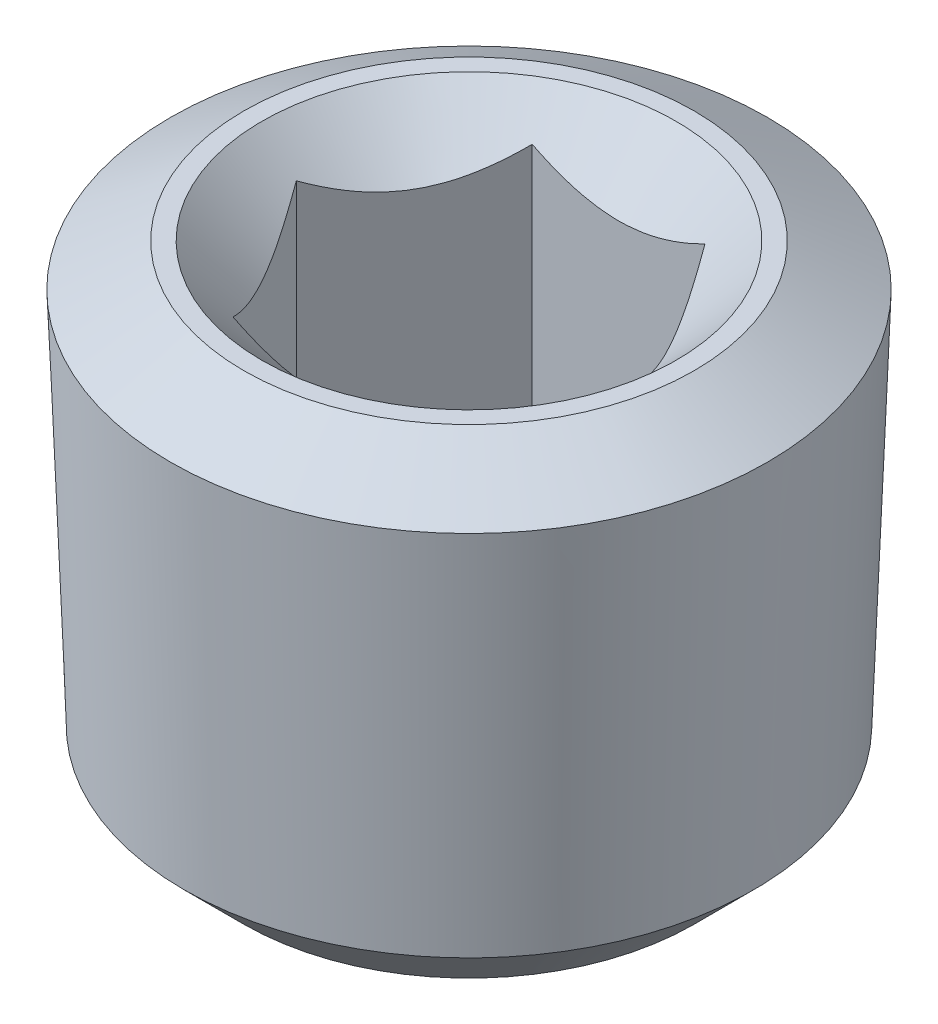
ISO-10303-21;
HEADER;
FILE_DESCRIPTION(('STEP AP214'),'2;1');
FILE_NAME('part.step','',(''),(''),'','','');
FILE_SCHEMA(('AUTOMOTIVE_DESIGN { 1 0 10303 214 1 1 1 1 }'));
ENDSEC;
DATA;
#1=APPLICATION_CONTEXT('core data for automotive mechanical design processes');
#2=APPLICATION_PROTOCOL_DEFINITION('international standard','automotive_design',2000,#1);
#3=PRODUCT_CONTEXT('',#1,'mechanical');
#4=PRODUCT('Part','Part','',(#3));
#5=PRODUCT_RELATED_PRODUCT_CATEGORY('part','',(#4));
#6=PRODUCT_DEFINITION_FORMATION('','',#4);
#7=PRODUCT_DEFINITION_CONTEXT('part definition',#1,'design');
#8=PRODUCT_DEFINITION('design','',#6,#7);
#9=PRODUCT_DEFINITION_SHAPE('','',#8);
#10=(LENGTH_UNIT() NAMED_UNIT(*) SI_UNIT(.MILLI.,.METRE.));
#11=(NAMED_UNIT(*) PLANE_ANGLE_UNIT() SI_UNIT($,.RADIAN.));
#12=(NAMED_UNIT(*) SI_UNIT($,.STERADIAN.) SOLID_ANGLE_UNIT());
#13=UNCERTAINTY_MEASURE_WITH_UNIT(LENGTH_MEASURE(1.E-05),#10,'distance_accuracy_value','');
#14=(GEOMETRIC_REPRESENTATION_CONTEXT(3) GLOBAL_UNCERTAINTY_ASSIGNED_CONTEXT((#13)) GLOBAL_UNIT_ASSIGNED_CONTEXT((#10,
#11,#12)) REPRESENTATION_CONTEXT('',''));
#15=CARTESIAN_POINT('',(0.,0.,0.));
#16=DIRECTION('',(0.,0.,1.));
#17=DIRECTION('',(1.,0.,0.));
#18=AXIS2_PLACEMENT_3D('',#15,#16,#17);
#19=CARTESIAN_POINT('',(0.,0.,0.));
#20=DIRECTION('',(0.,1.,0.));
#21=DIRECTION('',(0.,0.,1.));
#22=AXIS2_PLACEMENT_3D('',#19,#20,#21);
#23=PLANE('',#22);
#24=CARTESIAN_POINT('',(0.,0.,0.));
#25=DIRECTION('',(0.,1.,0.));
#26=DIRECTION('',(0.,0.,1.));
#27=AXIS2_PLACEMENT_3D('',#24,#25,#26);
#28=CIRCLE('',#27,2.7432);
#29=CARTESIAN_POINT('',(0.,0.,2.7432));
#30=VERTEX_POINT('',#29);
#31=EDGE_CURVE('E252',#30,#30,#28,.T.);
#32=ORIENTED_EDGE('',*,*,#31,.F.);
#33=EDGE_LOOP('',(#32));
#34=FACE_BOUND('',#33,.T.);
#35=CARTESIAN_POINT('',(0.,0.,0.));
#36=DIRECTION('',(0.,1.,0.));
#37=DIRECTION('',(0.,0.,1.));
#38=AXIS2_PLACEMENT_3D('',#35,#36,#37);
#39=CIRCLE('',#38,2.98158778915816);
#40=CARTESIAN_POINT('',(0.,0.,2.98158778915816));
#41=VERTEX_POINT('',#40);
#42=EDGE_CURVE('E12',#41,#41,#39,.T.);
#43=ORIENTED_EDGE('',*,*,#42,.T.);
#44=EDGE_LOOP('',(#43));
#45=FACE_BOUND('',#44,.T.);
#46=ADVANCED_FACE('F39',(#34,#45),#23,.T.);
#47=CARTESIAN_POINT('',(0.,0.,0.));
#48=DIRECTION('',(0.,-1.,0.));
#49=DIRECTION('',(0.,0.,-1.));
#50=AXIS2_PLACEMENT_3D('',#47,#48,#49);
#51=CONICAL_SURFACE('',#50,2.98158778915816,1.0471975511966);
#52=CARTESIAN_POINT('',(0.,-0.561779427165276,0.));
#53=DIRECTION('',(0.,1.,0.));
#54=DIRECTION('',(0.,0.,1.));
#55=AXIS2_PLACEMENT_3D('',#52,#53,#54);
#56=CIRCLE('',#55,3.95461829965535);
#57=CARTESIAN_POINT('',(0.,-0.561779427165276,3.95461829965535));
#58=VERTEX_POINT('',#57);
#59=EDGE_CURVE('E46',#58,#58,#56,.T.);
#60=ORIENTED_EDGE('',*,*,#59,.T.);
#61=EDGE_LOOP('',(#60));
#62=FACE_BOUND('',#61,.T.);
#63=ORIENTED_EDGE('',*,*,#42,.F.);
#64=EDGE_LOOP('',(#63));
#65=FACE_BOUND('',#64,.T.);
#66=ADVANCED_FACE('F242',(#62,#65),#51,.T.);
#67=CARTESIAN_POINT('',(0.,-0.561779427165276,0.));
#68=DIRECTION('',(0.,1.,0.));
#69=DIRECTION('',(0.,0.,1.));
#70=AXIS2_PLACEMENT_3D('',#67,#68,#69);
#71=CONICAL_SURFACE('',#70,3.95461829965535,0.0364424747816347);
#72=CARTESIAN_POINT('',(0.,-5.55916733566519,0.));
#73=DIRECTION('',(0.,1.,0.));
#74=DIRECTION('',(0.,0.,1.));
#75=AXIS2_PLACEMENT_3D('',#72,#73,#74);
#76=CIRCLE('',#75,3.77242045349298);
#77=CARTESIAN_POINT('',(0.,-5.55916733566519,3.77242045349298));
#78=VERTEX_POINT('',#77);
#79=EDGE_CURVE('E260',#78,#78,#76,.T.);
#80=ORIENTED_EDGE('',*,*,#79,.T.);
#81=EDGE_LOOP('',(#80));
#82=FACE_BOUND('',#81,.T.);
#83=ORIENTED_EDGE('',*,*,#59,.F.);
#84=EDGE_LOOP('',(#83));
#85=FACE_BOUND('',#84,.T.);
#86=ADVANCED_FACE('F247',(#82,#85),#71,.T.);
#87=CARTESIAN_POINT('',(0.,-5.55916733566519,0.));
#88=DIRECTION('',(0.,1.,0.));
#89=DIRECTION('',(0.,0.,1.));
#90=AXIS2_PLACEMENT_3D('',#87,#88,#89);
#91=CONICAL_SURFACE('',#90,3.77242045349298,0.785398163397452);
#92=CARTESIAN_POINT('',(0.,-6.35,0.));
#93=DIRECTION('',(0.,1.,0.));
#94=DIRECTION('',(0.,0.,1.));
#95=AXIS2_PLACEMENT_3D('',#92,#93,#94);
#96=CIRCLE('',#95,2.98158778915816);
#97=CARTESIAN_POINT('',(0.,-6.35,2.98158778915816));
#98=VERTEX_POINT('',#97);
#99=EDGE_CURVE('E256',#98,#98,#96,.T.);
#100=ORIENTED_EDGE('',*,*,#99,.T.);
#101=EDGE_LOOP('',(#100));
#102=FACE_BOUND('',#101,.T.);
#103=ORIENTED_EDGE('',*,*,#79,.F.);
#104=EDGE_LOOP('',(#103));
#105=FACE_BOUND('',#104,.T.);
#106=ADVANCED_FACE('F270',(#102,#105),#91,.T.);
#107=CARTESIAN_POINT('',(-2.98158778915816,-6.35,0.));
#108=DIRECTION('',(0.,-1.,0.));
#109=DIRECTION('',(0.,0.,-1.));
#110=AXIS2_PLACEMENT_3D('',#107,#108,#109);
#111=PLANE('',#110);
#112=ORIENTED_EDGE('',*,*,#99,.F.);
#113=EDGE_LOOP('',(#112));
#114=FACE_BOUND('',#113,.T.);
#115=ADVANCED_FACE('F186',(#114),#111,.T.);
#116=CARTESIAN_POINT('',(0.,0.,0.));
#117=DIRECTION('',(0.,1.,0.));
#118=DIRECTION('',(0.,0.,1.));
#119=AXIS2_PLACEMENT_3D('',#116,#117,#118);
#120=CONICAL_SURFACE('',#119,2.7432,0.785398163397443);
#121=CARTESIAN_POINT('',(-2.57510355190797,0.505847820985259,1.9812));
#122=CARTESIAN_POINT('',(-2.51354578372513,0.457069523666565,1.9812));
#123=CARTESIAN_POINT('',(-2.45167860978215,0.408675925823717,1.9812));
#124=CARTESIAN_POINT('',(-2.32719174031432,0.312839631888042,1.9812));
#125=CARTESIAN_POINT('',(-2.26457188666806,0.265397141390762,1.9812));
#126=CARTESIAN_POINT('',(-2.13799293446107,0.171309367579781,1.9812));
#127=CARTESIAN_POINT('',(-2.07402727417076,0.124672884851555,1.9812));
#128=CARTESIAN_POINT('',(-1.94507265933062,0.0328422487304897,1.9812));
#129=CARTESIAN_POINT('',(-1.88008377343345,-0.0123520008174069,1.9812));
#130=CARTESIAN_POINT('',(-1.74397621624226,-0.104279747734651,1.9812));
#131=CARTESIAN_POINT('',(-1.67276336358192,-0.150874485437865,1.9812));
#132=CARTESIAN_POINT('',(-1.52868136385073,-0.241424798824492,1.9812));
#133=CARTESIAN_POINT('',(-1.45581242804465,-0.285380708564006,1.9812));
#134=CARTESIAN_POINT('',(-1.30832056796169,-0.369762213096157,1.9812));
#135=CARTESIAN_POINT('',(-1.23370327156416,-0.410197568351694,1.9812));
#136=CARTESIAN_POINT('',(-1.08224421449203,-0.486624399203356,1.9812));
#137=CARTESIAN_POINT('',(-1.00540359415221,-0.522618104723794,1.9812));
#138=CARTESIAN_POINT('',(-0.859075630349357,-0.584647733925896,1.9812));
#139=CARTESIAN_POINT('',(-0.789880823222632,-0.611366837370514,1.9812));
#140=CARTESIAN_POINT('',(-0.649566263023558,-0.659274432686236,1.9812));
#141=CARTESIAN_POINT('',(-0.578446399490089,-0.68046260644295,1.9812));
#142=CARTESIAN_POINT('',(-0.436050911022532,-0.715727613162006,1.9812));
#143=CARTESIAN_POINT('',(-0.36481123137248,-0.729947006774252,1.9812));
#144=CARTESIAN_POINT('',(-0.221237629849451,-0.750948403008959,1.9812));
#145=CARTESIAN_POINT('',(-0.14890402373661,-0.757732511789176,1.9812));
#146=CARTESIAN_POINT('',(-0.00820637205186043,-0.763156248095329,1.9812));
#147=CARTESIAN_POINT('',(0.0601400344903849,-0.762252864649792,1.9812));
#148=CARTESIAN_POINT('',(0.196377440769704,-0.753452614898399,1.9812));
#149=CARTESIAN_POINT('',(0.264268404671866,-0.745555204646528,1.9812));
#150=CARTESIAN_POINT('',(0.400266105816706,-0.723106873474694,1.9812));
#151=CARTESIAN_POINT('',(0.468351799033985,-0.708430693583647,1.9812));
#152=CARTESIAN_POINT('',(0.602982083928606,-0.673292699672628,1.9812));
#153=CARTESIAN_POINT('',(0.669526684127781,-0.652830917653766,1.9812));
#154=CARTESIAN_POINT('',(0.867724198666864,-0.583887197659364,1.9812));
#155=CARTESIAN_POINT('',(0.996810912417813,-0.528063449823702,1.9812));
#156=CARTESIAN_POINT('',(1.2489899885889,-0.403752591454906,1.9812));
#157=CARTESIAN_POINT('',(1.3720599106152,-0.335222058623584,1.9812));
#158=CARTESIAN_POINT('',(1.54997195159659,-0.228144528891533,1.9812));
#159=CARTESIAN_POINT('',(1.60673701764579,-0.192728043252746,1.9812));
#160=CARTESIAN_POINT('',(1.71929230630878,-0.120366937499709,1.9812));
#161=CARTESIAN_POINT('',(1.77508245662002,-0.0834222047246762,1.9812));
#162=CARTESIAN_POINT('',(1.88537126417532,-0.00857930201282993,1.9812));
#163=CARTESIAN_POINT('',(1.93987664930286,0.0293090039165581,1.9812));
#164=CARTESIAN_POINT('',(2.04813768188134,0.106112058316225,1.9812));
#165=CARTESIAN_POINT('',(2.10189353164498,0.145026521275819,1.9812));
#166=CARTESIAN_POINT('',(2.15533457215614,0.184362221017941,1.9812));
#167=B_SPLINE_CURVE_WITH_KNOTS('',3,(#121,#122,#123,#124,#125,#126,#127,#128,#129,#130,#131,
#132,#133,#134,#135,#136,#137,#138,#139,#140,#141,#142,#143,#144,#145,#146,#147,#148,#149,#150,
#151,#152,#153,#154,#155,#156,#157,#158,#159,#160,#161,#162,#163,#164,#165,#166),.UNSPECIFIED.,
.F.,.F.,(4,2,2,2,2,2,2,2,2,2,2,2,2,2,2,2,2,2,2,2,2,2,4),(0.,0.235626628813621,0.471303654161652,
0.708772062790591,0.946224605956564,1.20148543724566,1.4567138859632,1.71121056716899,
1.9655789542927,2.18791541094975,2.41026465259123,2.62785270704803,2.84537911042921,
3.0500690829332,3.25477497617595,3.46342485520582,3.67207358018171,4.09278433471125,
4.51496018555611,4.71566341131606,4.91638145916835,5.11551042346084,5.31458455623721),.UNSPECIFIED.);
#168=CARTESIAN_POINT('',(1.14384635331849,-0.455507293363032,1.9812));
#169=VERTEX_POINT('',#168);
#170=CARTESIAN_POINT('',(-1.14384635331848,-0.455507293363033,1.9812));
#171=VERTEX_POINT('',#170);
#172=EDGE_CURVE('E53',#169,#171,#167,.F.);
#173=ORIENTED_EDGE('',*,*,#172,.T.);
#174=CARTESIAN_POINT('',(-1.14373088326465,-0.455391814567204,1.9814));
#175=CARTESIAN_POINT('',(-1.18305240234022,-0.494681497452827,1.91329313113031));
#176=CARTESIAN_POINT('',(-1.22303144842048,-0.531663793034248,1.84404739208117));
#177=CARTESIAN_POINT('',(-1.30455323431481,-0.599377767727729,1.70284751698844));
#178=CARTESIAN_POINT('',(-1.34610372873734,-0.630071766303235,1.63087994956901));
#179=CARTESIAN_POINT('',(-1.4298883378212,-0.682651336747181,1.48576074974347));
#180=CARTESIAN_POINT('',(-1.47210111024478,-0.70466907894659,1.41264608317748));
#181=CARTESIAN_POINT('',(-1.55745605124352,-0.738592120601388,1.26480698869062));
#182=CARTESIAN_POINT('',(-1.60059561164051,-0.750522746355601,1.19008707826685));
#183=CARTESIAN_POINT('',(-1.67494288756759,-0.761287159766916,1.0613138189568));
#184=CARTESIAN_POINT('',(-1.70605452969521,-0.76288080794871,1.00742687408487));
#185=CARTESIAN_POINT('',(-1.76822697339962,-0.760197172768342,0.899741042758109));
#186=CARTESIAN_POINT('',(-1.7992877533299,-0.755917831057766,0.845942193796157));
#187=CARTESIAN_POINT('',(-1.86111604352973,-0.741731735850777,0.738852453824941));
#188=CARTESIAN_POINT('',(-1.8918831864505,-0.731818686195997,0.685562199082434));
#189=CARTESIAN_POINT('',(-1.95288543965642,-0.706909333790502,0.579903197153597));
#190=CARTESIAN_POINT('',(-1.98312059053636,-0.691913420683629,0.527534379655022));
#191=CARTESIAN_POINT('',(-2.06057049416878,-0.647391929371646,0.393387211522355));
#192=CARTESIAN_POINT('',(-2.10730489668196,-0.614509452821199,0.312440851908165));
#193=CARTESIAN_POINT('',(-2.17602360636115,-0.558998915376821,0.19341655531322));
#194=CARTESIAN_POINT('',(-2.19866947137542,-0.539495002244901,0.15419276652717));
#195=CARTESIAN_POINT('',(-2.24354167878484,-0.498709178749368,0.0764718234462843));
#196=CARTESIAN_POINT('',(-2.26576826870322,-0.477428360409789,0.0379742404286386));
#197=CARTESIAN_POINT('',(-2.28780817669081,-0.455391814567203,-0.000200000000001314));
#198=B_SPLINE_CURVE_WITH_KNOTS('',3,(#174,#175,#176,#177,#178,#179,#180,#181,#182,#183,#184,
#185,#186,#187,#188,#189,#190,#191,#192,#193,#194,#195,#196,#197),.UNSPECIFIED.,.F.,.F.,(4,2,2,
2,2,2,2,2,2,2,2,4),(0.,0.263916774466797,0.529371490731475,0.79060967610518,1.05118999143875,
1.23765676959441,1.42418891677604,1.61092994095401,1.79765665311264,2.09428646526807,
2.24219924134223,2.39002177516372),.UNSPECIFIED.);
#199=CARTESIAN_POINT('',(-2.28769270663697,-0.455507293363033,0.));
#200=VERTEX_POINT('',#199);
#201=EDGE_CURVE('E128',#171,#200,#198,.T.);
#202=ORIENTED_EDGE('',*,*,#201,.T.);
#203=CARTESIAN_POINT('',(-2.28780817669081,-0.455391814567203,0.000199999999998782));
#204=CARTESIAN_POINT('',(-2.24848665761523,-0.494681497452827,-0.0679068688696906));
#205=CARTESIAN_POINT('',(-2.20850761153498,-0.531663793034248,-0.137152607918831));
#206=CARTESIAN_POINT('',(-2.12698582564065,-0.599377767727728,-0.278352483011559));
#207=CARTESIAN_POINT('',(-2.08543533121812,-0.630071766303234,-0.350320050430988));
#208=CARTESIAN_POINT('',(-2.00165072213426,-0.68265133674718,-0.495439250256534));
#209=CARTESIAN_POINT('',(-1.95943794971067,-0.704669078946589,-0.568553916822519));
#210=CARTESIAN_POINT('',(-1.87408300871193,-0.738592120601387,-0.71639301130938));
#211=CARTESIAN_POINT('',(-1.83094344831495,-0.750522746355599,-0.791112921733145));
#212=CARTESIAN_POINT('',(-1.75659617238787,-0.761287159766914,-0.919886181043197));
#213=CARTESIAN_POINT('',(-1.72548453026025,-0.762880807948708,-0.973773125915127));
#214=CARTESIAN_POINT('',(-1.66331208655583,-0.76019717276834,-1.08145895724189));
#215=CARTESIAN_POINT('',(-1.63225130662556,-0.755917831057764,-1.13525780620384));
#216=CARTESIAN_POINT('',(-1.57042301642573,-0.741731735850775,-1.24234754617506));
#217=CARTESIAN_POINT('',(-1.53965587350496,-0.731818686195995,-1.29563780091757));
#218=CARTESIAN_POINT('',(-1.47865362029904,-0.7069093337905,-1.4012968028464));
#219=CARTESIAN_POINT('',(-1.44841846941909,-0.691913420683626,-1.45366562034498));
#220=CARTESIAN_POINT('',(-1.37096856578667,-0.647391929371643,-1.58781278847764));
#221=CARTESIAN_POINT('',(-1.3242341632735,-0.614509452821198,-1.66875914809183));
#222=CARTESIAN_POINT('',(-1.2555154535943,-0.558998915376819,-1.78778344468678));
#223=CARTESIAN_POINT('',(-1.23286958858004,-0.5394950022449,-1.82700723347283));
#224=CARTESIAN_POINT('',(-1.18799738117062,-0.498709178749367,-1.90472817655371));
#225=CARTESIAN_POINT('',(-1.16577079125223,-0.477428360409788,-1.94322575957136));
#226=CARTESIAN_POINT('',(-1.14373088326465,-0.455391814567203,-1.9814));
#227=B_SPLINE_CURVE_WITH_KNOTS('',3,(#203,#204,#205,#206,#207,#208,#209,#210,#211,#212,#213,
#214,#215,#216,#217,#218,#219,#220,#221,#222,#223,#224,#225,#226),.UNSPECIFIED.,.F.,.F.,(4,2,2,
2,2,2,2,2,2,2,2,4),(0.,0.263916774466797,0.529371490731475,0.790609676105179,1.05118999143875,
1.23765676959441,1.42418891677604,1.61092994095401,1.79765665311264,2.09428646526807,
2.24219924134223,2.39002177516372),.UNSPECIFIED.);
#228=CARTESIAN_POINT('',(-1.14384635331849,-0.455507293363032,-1.9812));
#229=VERTEX_POINT('',#228);
#230=EDGE_CURVE('E209',#200,#229,#227,.T.);
#231=ORIENTED_EDGE('',*,*,#230,.T.);
#232=CARTESIAN_POINT('',(-2.57510355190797,0.505847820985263,-1.9812));
#233=CARTESIAN_POINT('',(-2.51354578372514,0.457069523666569,-1.9812));
#234=CARTESIAN_POINT('',(-2.45167860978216,0.408675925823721,-1.9812));
#235=CARTESIAN_POINT('',(-2.32719174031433,0.312839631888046,-1.9812));
#236=CARTESIAN_POINT('',(-2.26457188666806,0.265397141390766,-1.9812));
#237=CARTESIAN_POINT('',(-2.13799293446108,0.171309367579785,-1.9812));
#238=CARTESIAN_POINT('',(-2.07402727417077,0.124672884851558,-1.9812));
#239=CARTESIAN_POINT('',(-1.94507265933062,0.0328422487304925,-1.9812));
#240=CARTESIAN_POINT('',(-1.88008377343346,-0.0123520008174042,-1.9812));
#241=CARTESIAN_POINT('',(-1.74397621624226,-0.104279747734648,-1.9812));
#242=CARTESIAN_POINT('',(-1.67276336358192,-0.150874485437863,-1.9812));
#243=CARTESIAN_POINT('',(-1.52868136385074,-0.24142479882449,-1.9812));
#244=CARTESIAN_POINT('',(-1.45581242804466,-0.285380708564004,-1.9812));
#245=CARTESIAN_POINT('',(-1.30832056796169,-0.369762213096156,-1.9812));
#246=CARTESIAN_POINT('',(-1.23370327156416,-0.410197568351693,-1.9812));
#247=CARTESIAN_POINT('',(-1.08224421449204,-0.486624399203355,-1.9812));
#248=CARTESIAN_POINT('',(-1.00540359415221,-0.522618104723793,-1.9812));
#249=CARTESIAN_POINT('',(-0.859075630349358,-0.584647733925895,-1.9812));
#250=CARTESIAN_POINT('',(-0.789880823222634,-0.611366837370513,-1.9812));
#251=CARTESIAN_POINT('',(-0.649566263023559,-0.659274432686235,-1.9812));
#252=CARTESIAN_POINT('',(-0.57844639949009,-0.680462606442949,-1.9812));
#253=CARTESIAN_POINT('',(-0.436050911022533,-0.715727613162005,-1.9812));
#254=CARTESIAN_POINT('',(-0.364811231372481,-0.729947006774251,-1.9812));
#255=CARTESIAN_POINT('',(-0.221237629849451,-0.750948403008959,-1.9812));
#256=CARTESIAN_POINT('',(-0.148904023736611,-0.757732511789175,-1.9812));
#257=CARTESIAN_POINT('',(-0.00820637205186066,-0.763156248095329,-1.9812));
#258=CARTESIAN_POINT('',(0.0601400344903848,-0.762252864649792,-1.9812));
#259=CARTESIAN_POINT('',(0.196377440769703,-0.753452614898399,-1.9812));
#260=CARTESIAN_POINT('',(0.264268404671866,-0.745555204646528,-1.9812));
#261=CARTESIAN_POINT('',(0.400266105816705,-0.723106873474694,-1.9812));
#262=CARTESIAN_POINT('',(0.468351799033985,-0.708430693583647,-1.9812));
#263=CARTESIAN_POINT('',(0.602982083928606,-0.673292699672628,-1.9812));
#264=CARTESIAN_POINT('',(0.669526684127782,-0.652830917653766,-1.9812));
#265=CARTESIAN_POINT('',(0.867724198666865,-0.583887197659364,-1.9812));
#266=CARTESIAN_POINT('',(0.996810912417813,-0.528063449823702,-1.9812));
#267=CARTESIAN_POINT('',(1.2489899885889,-0.403752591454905,-1.9812));
#268=CARTESIAN_POINT('',(1.3720599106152,-0.335222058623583,-1.9812));
#269=CARTESIAN_POINT('',(1.54997195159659,-0.228144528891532,-1.9812));
#270=CARTESIAN_POINT('',(1.60673701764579,-0.192728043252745,-1.9812));
#271=CARTESIAN_POINT('',(1.71929230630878,-0.120366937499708,-1.9812));
#272=CARTESIAN_POINT('',(1.77508245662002,-0.0834222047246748,-1.9812));
#273=CARTESIAN_POINT('',(1.88537126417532,-0.00857930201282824,-1.9812));
#274=CARTESIAN_POINT('',(1.93987664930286,0.0293090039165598,-1.9812));
#275=CARTESIAN_POINT('',(2.04813768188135,0.106112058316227,-1.9812));
#276=CARTESIAN_POINT('',(2.10189353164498,0.145026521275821,-1.9812));
#277=CARTESIAN_POINT('',(2.15533457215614,0.184362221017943,-1.9812));
#278=B_SPLINE_CURVE_WITH_KNOTS('',3,(#232,#233,#234,#235,#236,#237,#238,#239,#240,#241,#242,
#243,#244,#245,#246,#247,#248,#249,#250,#251,#252,#253,#254,#255,#256,#257,#258,#259,#260,#261,
#262,#263,#264,#265,#266,#267,#268,#269,#270,#271,#272,#273,#274,#275,#276,#277),.UNSPECIFIED.,
.F.,.F.,(4,2,2,2,2,2,2,2,2,2,2,2,2,2,2,2,2,2,2,2,2,2,4),(0.,0.235626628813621,0.471303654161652,
0.708772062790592,0.946224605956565,1.20148543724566,1.4567138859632,1.71121056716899,
1.96557895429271,2.18791541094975,2.41026465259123,2.62785270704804,2.84537911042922,
3.05006908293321,3.25477497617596,3.46342485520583,3.67207358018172,4.09278433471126,
4.51496018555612,4.71566341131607,4.91638145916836,5.11551042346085,5.31458455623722),.UNSPECIFIED.);
#279=CARTESIAN_POINT('',(1.14384635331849,-0.455507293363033,-1.9812));
#280=VERTEX_POINT('',#279);
#281=EDGE_CURVE('E202',#229,#280,#278,.T.);
#282=ORIENTED_EDGE('',*,*,#281,.T.);
#283=CARTESIAN_POINT('',(1.14373088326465,-0.455391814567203,-1.9814));
#284=CARTESIAN_POINT('',(1.18305240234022,-0.494681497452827,-1.91329313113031));
#285=CARTESIAN_POINT('',(1.22303144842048,-0.531663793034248,-1.84404739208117));
#286=CARTESIAN_POINT('',(1.30455323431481,-0.599377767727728,-1.70284751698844));
#287=CARTESIAN_POINT('',(1.34610372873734,-0.630071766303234,-1.63087994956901));
#288=CARTESIAN_POINT('',(1.4298883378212,-0.68265133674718,-1.48576074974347));
#289=CARTESIAN_POINT('',(1.47210111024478,-0.704669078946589,-1.41264608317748));
#290=CARTESIAN_POINT('',(1.55745605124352,-0.738592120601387,-1.26480698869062));
#291=CARTESIAN_POINT('',(1.60059561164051,-0.750522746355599,-1.19008707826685));
#292=CARTESIAN_POINT('',(1.67494288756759,-0.761287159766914,-1.0613138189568));
#293=CARTESIAN_POINT('',(1.70605452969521,-0.762880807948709,-1.00742687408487));
#294=CARTESIAN_POINT('',(1.76822697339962,-0.760197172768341,-0.899741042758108));
#295=CARTESIAN_POINT('',(1.7992877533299,-0.755917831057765,-0.845942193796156));
#296=CARTESIAN_POINT('',(1.86111604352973,-0.741731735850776,-0.73885245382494));
#297=CARTESIAN_POINT('',(1.8918831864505,-0.731818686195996,-0.685562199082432));
#298=CARTESIAN_POINT('',(1.95288543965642,-0.7069093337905,-0.579903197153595));
#299=CARTESIAN_POINT('',(1.98312059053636,-0.691913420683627,-0.527534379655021));
#300=CARTESIAN_POINT('',(2.06057049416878,-0.647391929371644,-0.393387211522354));
#301=CARTESIAN_POINT('',(2.10730489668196,-0.614509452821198,-0.312440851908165));
#302=CARTESIAN_POINT('',(2.17602360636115,-0.55899891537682,-0.193416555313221));
#303=CARTESIAN_POINT('',(2.19866947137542,-0.539495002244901,-0.154192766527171));
#304=CARTESIAN_POINT('',(2.24354167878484,-0.498709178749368,-0.076471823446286));
#305=CARTESIAN_POINT('',(2.26576826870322,-0.477428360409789,-0.0379742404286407));
#306=CARTESIAN_POINT('',(2.28780817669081,-0.455391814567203,0.00019999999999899));
#307=B_SPLINE_CURVE_WITH_KNOTS('',3,(#283,#284,#285,#286,#287,#288,#289,#290,#291,#292,#293,
#294,#295,#296,#297,#298,#299,#300,#301,#302,#303,#304,#305,#306),.UNSPECIFIED.,.F.,.F.,(4,2,2,
2,2,2,2,2,2,2,2,4),(0.,0.263916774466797,0.529371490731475,0.79060967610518,1.05118999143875,
1.23765676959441,1.42418891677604,1.61092994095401,1.79765665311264,2.09428646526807,
2.24219924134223,2.39002177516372),.UNSPECIFIED.);
#308=CARTESIAN_POINT('',(2.28769270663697,-0.455507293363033,0.));
#309=VERTEX_POINT('',#308);
#310=EDGE_CURVE('E195',#280,#309,#307,.T.);
#311=ORIENTED_EDGE('',*,*,#310,.T.);
#312=CARTESIAN_POINT('',(2.28780817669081,-0.455391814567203,-0.00020000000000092));
#313=CARTESIAN_POINT('',(2.24848665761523,-0.494681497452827,0.0679068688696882));
#314=CARTESIAN_POINT('',(2.20850761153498,-0.531663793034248,0.137152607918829));
#315=CARTESIAN_POINT('',(2.12698582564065,-0.599377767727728,0.278352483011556));
#316=CARTESIAN_POINT('',(2.08543533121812,-0.630071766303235,0.350320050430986));
#317=CARTESIAN_POINT('',(2.00165072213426,-0.682651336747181,0.495439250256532));
#318=CARTESIAN_POINT('',(1.95943794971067,-0.704669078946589,0.568553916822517));
#319=CARTESIAN_POINT('',(1.87408300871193,-0.738592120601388,0.716393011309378));
#320=CARTESIAN_POINT('',(1.83094344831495,-0.7505227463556,0.791112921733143));
#321=CARTESIAN_POINT('',(1.75659617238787,-0.761287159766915,0.919886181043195));
#322=CARTESIAN_POINT('',(1.72548453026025,-0.762880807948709,0.973773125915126));
#323=CARTESIAN_POINT('',(1.66331208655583,-0.760197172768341,1.08145895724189));
#324=CARTESIAN_POINT('',(1.63225130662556,-0.755917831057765,1.13525780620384));
#325=CARTESIAN_POINT('',(1.57042301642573,-0.741731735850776,1.24234754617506));
#326=CARTESIAN_POINT('',(1.53965587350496,-0.731818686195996,1.29563780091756));
#327=CARTESIAN_POINT('',(1.47865362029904,-0.706909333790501,1.4012968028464));
#328=CARTESIAN_POINT('',(1.44841846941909,-0.691913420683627,1.45366562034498));
#329=CARTESIAN_POINT('',(1.37096856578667,-0.647391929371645,1.58781278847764));
#330=CARTESIAN_POINT('',(1.3242341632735,-0.614509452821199,1.66875914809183));
#331=CARTESIAN_POINT('',(1.2555154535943,-0.55899891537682,1.78778344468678));
#332=CARTESIAN_POINT('',(1.23286958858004,-0.5394950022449,1.82700723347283));
#333=CARTESIAN_POINT('',(1.18799738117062,-0.498709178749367,1.90472817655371));
#334=CARTESIAN_POINT('',(1.16577079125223,-0.477428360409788,1.94322575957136));
#335=CARTESIAN_POINT('',(1.14373088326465,-0.455391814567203,1.9814));
#336=B_SPLINE_CURVE_WITH_KNOTS('',3,(#312,#313,#314,#315,#316,#317,#318,#319,#320,#321,#322,
#323,#324,#325,#326,#327,#328,#329,#330,#331,#332,#333,#334,#335),.UNSPECIFIED.,.F.,.F.,(4,2,2,
2,2,2,2,2,2,2,2,4),(0.,0.263916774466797,0.529371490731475,0.79060967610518,1.05118999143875,
1.23765676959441,1.42418891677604,1.61092994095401,1.79765665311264,2.09428646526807,
2.24219924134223,2.39002177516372),.UNSPECIFIED.);
#337=EDGE_CURVE('E172',#309,#169,#336,.T.);
#338=ORIENTED_EDGE('',*,*,#337,.T.);
#339=EDGE_LOOP('',(#173,#202,#231,#282,#311,#338));
#340=FACE_BOUND('',#339,.T.);
#341=ORIENTED_EDGE('',*,*,#31,.T.);
#342=EDGE_LOOP('',(#341));
#343=FACE_BOUND('',#342,.T.);
#344=ADVANCED_FACE('F181',(#340,#343),#120,.F.);
#345=CARTESIAN_POINT('',(-2.28769270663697,-3.81,0.));
#346=DIRECTION('',(-0.866025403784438,0.,0.5));
#347=DIRECTION('',(0.5,0.,0.866025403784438));
#348=AXIS2_PLACEMENT_3D('',#345,#346,#347);
#349=PLANE('',#348);
#350=DIRECTION('',(0.,1.,0.));
#351=VECTOR('',#350,1.);
#352=CARTESIAN_POINT('',(-1.14384635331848,-3.81,1.9812));
#353=LINE('',#352,#351);
#354=CARTESIAN_POINT('',(-1.14384635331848,-3.81,1.9812));
#355=VERTEX_POINT('',#354);
#356=EDGE_CURVE('E125',#355,#171,#353,.T.);
#357=ORIENTED_EDGE('',*,*,#356,.F.);
#358=DIRECTION('',(0.5,0.,0.866025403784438));
#359=VECTOR('',#358,1.);
#360=CARTESIAN_POINT('',(-2.28769270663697,-3.81,0.));
#361=LINE('',#360,#359);
#362=CARTESIAN_POINT('',(-1.71576952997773,-3.81,0.990599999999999));
#363=VERTEX_POINT('',#362);
#364=EDGE_CURVE('E112',#363,#355,#361,.T.);
#365=ORIENTED_EDGE('',*,*,#364,.F.);
#366=CARTESIAN_POINT('',(-2.28769270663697,-3.81,0.));
#367=VERTEX_POINT('',#366);
#368=EDGE_CURVE('E122',#367,#363,#361,.T.);
#369=ORIENTED_EDGE('',*,*,#368,.F.);
#370=DIRECTION('',(0.,1.,0.));
#371=VECTOR('',#370,1.);
#372=CARTESIAN_POINT('',(-2.28769270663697,-3.81,0.));
#373=LINE('',#372,#371);
#374=EDGE_CURVE('E152',#367,#200,#373,.T.);
#375=ORIENTED_EDGE('',*,*,#374,.T.);
#376=ORIENTED_EDGE('',*,*,#201,.F.);
#377=EDGE_LOOP('',(#357,#365,#369,#375,#376));
#378=FACE_BOUND('',#377,.T.);
#379=ADVANCED_FACE('F126',(#378),#349,.F.);
#380=CARTESIAN_POINT('',(-1.14384635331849,-3.81,-1.9812));
#381=DIRECTION('',(-0.866025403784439,0.,-0.5));
#382=DIRECTION('',(-0.5,0.,0.866025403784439));
#383=AXIS2_PLACEMENT_3D('',#380,#381,#382);
#384=PLANE('',#383);
#385=ORIENTED_EDGE('',*,*,#374,.F.);
#386=DIRECTION('',(-0.5,0.,0.866025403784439));
#387=VECTOR('',#386,1.);
#388=CARTESIAN_POINT('',(-1.14384635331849,-3.81,-1.9812));
#389=LINE('',#388,#387);
#390=CARTESIAN_POINT('',(-1.71576952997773,-3.81,-0.990599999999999));
#391=VERTEX_POINT('',#390);
#392=EDGE_CURVE('E149',#391,#367,#389,.T.);
#393=ORIENTED_EDGE('',*,*,#392,.F.);
#394=CARTESIAN_POINT('',(-1.14384635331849,-3.81,-1.9812));
#395=VERTEX_POINT('',#394);
#396=EDGE_CURVE('E131',#395,#391,#389,.T.);
#397=ORIENTED_EDGE('',*,*,#396,.F.);
#398=DIRECTION('',(0.,1.,0.));
#399=VECTOR('',#398,1.);
#400=CARTESIAN_POINT('',(-1.14384635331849,-3.81,-1.9812));
#401=LINE('',#400,#399);
#402=EDGE_CURVE('E154',#395,#229,#401,.T.);
#403=ORIENTED_EDGE('',*,*,#402,.T.);
#404=ORIENTED_EDGE('',*,*,#230,.F.);
#405=EDGE_LOOP('',(#385,#393,#397,#403,#404));
#406=FACE_BOUND('',#405,.T.);
#407=ADVANCED_FACE('F220',(#406),#384,.F.);
#408=CARTESIAN_POINT('',(1.14384635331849,-3.81,-1.9812));
#409=DIRECTION('',(0.,0.,-1.));
#410=DIRECTION('',(-1.,0.,0.));
#411=AXIS2_PLACEMENT_3D('',#408,#409,#410);
#412=PLANE('',#411);
#413=ORIENTED_EDGE('',*,*,#402,.F.);
#414=DIRECTION('',(-1.,0.,0.));
#415=VECTOR('',#414,1.);
#416=CARTESIAN_POINT('',(1.14384635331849,-3.81,-1.9812));
#417=LINE('',#416,#415);
#418=CARTESIAN_POINT('',(0.,-3.81,-1.9812));
#419=VERTEX_POINT('',#418);
#420=EDGE_CURVE('E145',#419,#395,#417,.T.);
#421=ORIENTED_EDGE('',*,*,#420,.F.);
#422=CARTESIAN_POINT('',(1.14384635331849,-3.81,-1.9812));
#423=VERTEX_POINT('',#422);
#424=EDGE_CURVE('E146',#423,#419,#417,.T.);
#425=ORIENTED_EDGE('',*,*,#424,.F.);
#426=DIRECTION('',(0.,1.,0.));
#427=VECTOR('',#426,1.);
#428=CARTESIAN_POINT('',(1.14384635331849,-3.81,-1.9812));
#429=LINE('',#428,#427);
#430=EDGE_CURVE('E157',#423,#280,#429,.T.);
#431=ORIENTED_EDGE('',*,*,#430,.T.);
#432=ORIENTED_EDGE('',*,*,#281,.F.);
#433=EDGE_LOOP('',(#413,#421,#425,#431,#432));
#434=FACE_BOUND('',#433,.T.);
#435=ADVANCED_FACE('F224',(#434),#412,.F.);
#436=CARTESIAN_POINT('',(2.28769270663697,-3.81,0.));
#437=DIRECTION('',(0.866025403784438,0.,-0.5));
#438=DIRECTION('',(-0.5,0.,-0.866025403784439));
#439=AXIS2_PLACEMENT_3D('',#436,#437,#438);
#440=PLANE('',#439);
#441=ORIENTED_EDGE('',*,*,#430,.F.);
#442=DIRECTION('',(-0.5,0.,-0.866025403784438));
#443=VECTOR('',#442,1.);
#444=CARTESIAN_POINT('',(2.28769270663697,-3.81,0.));
#445=LINE('',#444,#443);
#446=CARTESIAN_POINT('',(1.71576952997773,-3.81,-0.9906));
#447=VERTEX_POINT('',#446);
#448=EDGE_CURVE('E141',#447,#423,#445,.T.);
#449=ORIENTED_EDGE('',*,*,#448,.F.);
#450=CARTESIAN_POINT('',(2.28769270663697,-3.81,0.));
#451=VERTEX_POINT('',#450);
#452=EDGE_CURVE('E142',#451,#447,#445,.T.);
#453=ORIENTED_EDGE('',*,*,#452,.F.);
#454=DIRECTION('',(0.,1.,0.));
#455=VECTOR('',#454,1.);
#456=CARTESIAN_POINT('',(2.28769270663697,-3.81,0.));
#457=LINE('',#456,#455);
#458=EDGE_CURVE('E160',#451,#309,#457,.T.);
#459=ORIENTED_EDGE('',*,*,#458,.T.);
#460=ORIENTED_EDGE('',*,*,#310,.F.);
#461=EDGE_LOOP('',(#441,#449,#453,#459,#460));
#462=FACE_BOUND('',#461,.T.);
#463=ADVANCED_FACE('F228',(#462),#440,.F.);
#464=CARTESIAN_POINT('',(1.14384635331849,-3.81,1.9812));
#465=DIRECTION('',(0.866025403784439,0.,0.5));
#466=DIRECTION('',(0.5,0.,-0.866025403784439));
#467=AXIS2_PLACEMENT_3D('',#464,#465,#466);
#468=PLANE('',#467);
#469=ORIENTED_EDGE('',*,*,#458,.F.);
#470=DIRECTION('',(0.5,0.,-0.866025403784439));
#471=VECTOR('',#470,1.);
#472=CARTESIAN_POINT('',(1.14384635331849,-3.81,1.9812));
#473=LINE('',#472,#471);
#474=CARTESIAN_POINT('',(1.71576952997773,-3.81,0.990599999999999));
#475=VERTEX_POINT('',#474);
#476=EDGE_CURVE('E137',#475,#451,#473,.T.);
#477=ORIENTED_EDGE('',*,*,#476,.F.);
#478=CARTESIAN_POINT('',(1.14384635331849,-3.81,1.9812));
#479=VERTEX_POINT('',#478);
#480=EDGE_CURVE('E61',#479,#475,#473,.T.);
#481=ORIENTED_EDGE('',*,*,#480,.F.);
#482=DIRECTION('',(0.,1.,0.));
#483=VECTOR('',#482,1.);
#484=CARTESIAN_POINT('',(1.14384635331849,-3.81,1.9812));
#485=LINE('',#484,#483);
#486=EDGE_CURVE('E130',#479,#169,#485,.T.);
#487=ORIENTED_EDGE('',*,*,#486,.T.);
#488=ORIENTED_EDGE('',*,*,#337,.F.);
#489=EDGE_LOOP('',(#469,#477,#481,#487,#488));
#490=FACE_BOUND('',#489,.T.);
#491=ADVANCED_FACE('F232',(#490),#468,.F.);
#492=CARTESIAN_POINT('',(-1.14384635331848,-3.81,1.9812));
#493=DIRECTION('',(0.,0.,1.));
#494=DIRECTION('',(1.,0.,0.));
#495=AXIS2_PLACEMENT_3D('',#492,#493,#494);
#496=PLANE('',#495);
#497=ORIENTED_EDGE('',*,*,#486,.F.);
#498=DIRECTION('',(1.,0.,0.));
#499=VECTOR('',#498,1.);
#500=CARTESIAN_POINT('',(-1.14384635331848,-3.81,1.9812));
#501=LINE('',#500,#499);
#502=CARTESIAN_POINT('',(0.,-3.81,1.9812));
#503=VERTEX_POINT('',#502);
#504=EDGE_CURVE('E136',#503,#479,#501,.T.);
#505=ORIENTED_EDGE('',*,*,#504,.F.);
#506=EDGE_CURVE('E116',#355,#503,#501,.T.);
#507=ORIENTED_EDGE('',*,*,#506,.F.);
#508=ORIENTED_EDGE('',*,*,#356,.T.);
#509=ORIENTED_EDGE('',*,*,#172,.F.);
#510=EDGE_LOOP('',(#497,#505,#507,#508,#509));
#511=FACE_BOUND('',#510,.T.);
#512=ADVANCED_FACE('F135',(#511),#496,.F.);
#513=CARTESIAN_POINT('',(0.,-3.81,0.));
#514=DIRECTION('',(0.,1.,0.));
#515=DIRECTION('',(0.,0.,1.));
#516=AXIS2_PLACEMENT_3D('',#513,#514,#515);
#517=PLANE('',#516);
#518=CARTESIAN_POINT('',(0.,-3.81,0.));
#519=DIRECTION('',(0.,1.,0.));
#520=DIRECTION('',(0.,0.,1.));
#521=AXIS2_PLACEMENT_3D('',#518,#519,#520);
#522=CIRCLE('',#521,1.9812);
#523=EDGE_CURVE('E118',#363,#503,#522,.T.);
#524=ORIENTED_EDGE('',*,*,#523,.F.);
#525=ORIENTED_EDGE('',*,*,#364,.T.);
#526=ORIENTED_EDGE('',*,*,#506,.T.);
#527=EDGE_LOOP('',(#524,#525,#526));
#528=FACE_BOUND('',#527,.T.);
#529=ADVANCED_FACE('F114',(#528),#517,.T.);
#530=EDGE_CURVE('E456',#391,#363,#522,.T.);
#531=ORIENTED_EDGE('',*,*,#530,.F.);
#532=ORIENTED_EDGE('',*,*,#392,.T.);
#533=ORIENTED_EDGE('',*,*,#368,.T.);
#534=EDGE_LOOP('',(#531,#532,#533));
#535=FACE_BOUND('',#534,.T.);
#536=ADVANCED_FACE('F329',(#535),#517,.T.);
#537=EDGE_CURVE('E454',#419,#391,#522,.T.);
#538=ORIENTED_EDGE('',*,*,#537,.F.);
#539=ORIENTED_EDGE('',*,*,#420,.T.);
#540=ORIENTED_EDGE('',*,*,#396,.T.);
#541=EDGE_LOOP('',(#538,#539,#540));
#542=FACE_BOUND('',#541,.T.);
#543=ADVANCED_FACE('F339',(#542),#517,.T.);
#544=EDGE_CURVE('E453',#447,#419,#522,.T.);
#545=ORIENTED_EDGE('',*,*,#544,.F.);
#546=ORIENTED_EDGE('',*,*,#448,.T.);
#547=ORIENTED_EDGE('',*,*,#424,.T.);
#548=EDGE_LOOP('',(#545,#546,#547));
#549=FACE_BOUND('',#548,.T.);
#550=ADVANCED_FACE('F349',(#549),#517,.T.);
#551=EDGE_CURVE('E263',#475,#447,#522,.T.);
#552=ORIENTED_EDGE('',*,*,#551,.F.);
#553=ORIENTED_EDGE('',*,*,#476,.T.);
#554=ORIENTED_EDGE('',*,*,#452,.T.);
#555=EDGE_LOOP('',(#552,#553,#554));
#556=FACE_BOUND('',#555,.T.);
#557=ADVANCED_FACE('F359',(#556),#517,.T.);
#558=EDGE_CURVE('E257',#503,#475,#522,.T.);
#559=ORIENTED_EDGE('',*,*,#558,.F.);
#560=ORIENTED_EDGE('',*,*,#504,.T.);
#561=ORIENTED_EDGE('',*,*,#480,.T.);
#562=EDGE_LOOP('',(#559,#560,#561));
#563=FACE_BOUND('',#562,.T.);
#564=ADVANCED_FACE('F330',(#563),#517,.T.);
#565=CARTESIAN_POINT('',(0.,-3.81,0.));
#566=DIRECTION('',(0.,1.,0.));
#567=DIRECTION('',(0.,0.,1.));
#568=AXIS2_PLACEMENT_3D('',#565,#566,#567);
#569=CONICAL_SURFACE('',#568,1.9812,1.02974425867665);
#570=CARTESIAN_POINT('',(0.,-5.00042505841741,0.));
#571=VERTEX_POINT('',#570);
#572=VERTEX_LOOP('',#571);
#573=FACE_BOUND('',#572,.T.);
#574=ORIENTED_EDGE('',*,*,#558,.T.);
#575=ORIENTED_EDGE('',*,*,#551,.T.);
#576=ORIENTED_EDGE('',*,*,#544,.T.);
#577=ORIENTED_EDGE('',*,*,#537,.T.);
#578=ORIENTED_EDGE('',*,*,#530,.T.);
#579=ORIENTED_EDGE('',*,*,#523,.T.);
#580=EDGE_LOOP('',(#574,#575,#576,#577,#578,#579));
#581=FACE_BOUND('',#580,.T.);
#582=ADVANCED_FACE('F187',(#573,#581),#569,.F.);
#583=CLOSED_SHELL('',(#46,#66,#86,#106,#115,#344,#379,#407,#435,#463,#491,#512,#529,#536,#543,
#550,#557,#564,#582));
#584=MANIFOLD_SOLID_BREP('B2',#583);
#585=ADVANCED_BREP_SHAPE_REPRESENTATION('',(#18,#584),#14);
#586=SHAPE_DEFINITION_REPRESENTATION(#9,#585);
ENDSEC;
END-ISO-10303-21;
